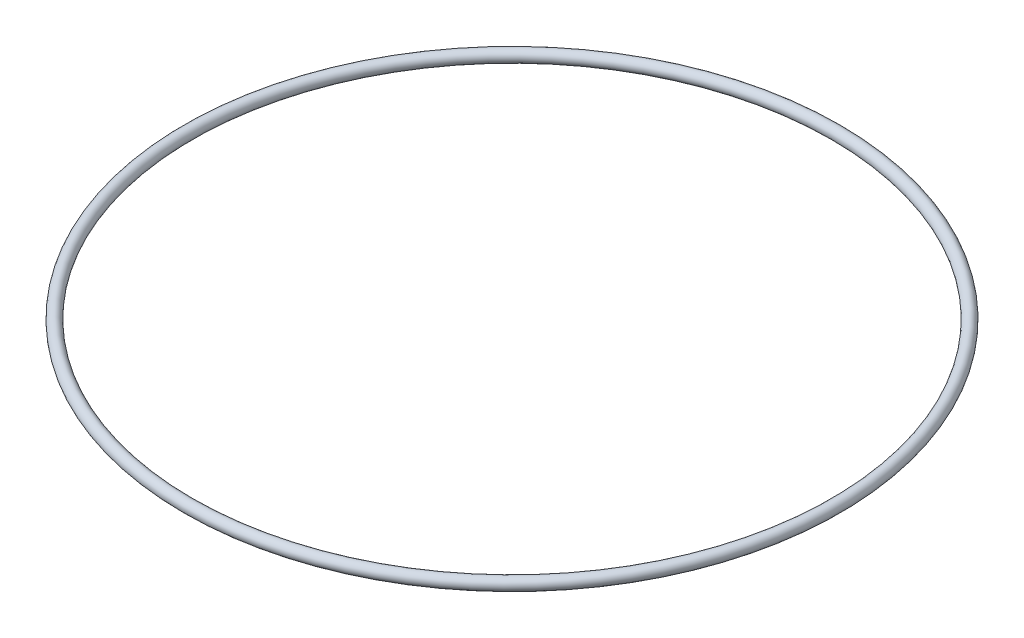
ISO-10303-21;
HEADER;
FILE_DESCRIPTION(('STEP AP214'),'2;1');
FILE_NAME('part.step','',(''),(''),'','','');
FILE_SCHEMA(('AUTOMOTIVE_DESIGN { 1 0 10303 214 1 1 1 1 }'));
ENDSEC;
DATA;
#1=APPLICATION_CONTEXT('core data for automotive mechanical design processes');
#2=APPLICATION_PROTOCOL_DEFINITION('international standard','automotive_design',2000,#1);
#3=PRODUCT_CONTEXT('',#1,'mechanical');
#4=PRODUCT('Part','Part','',(#3));
#5=PRODUCT_RELATED_PRODUCT_CATEGORY('part','',(#4));
#6=PRODUCT_DEFINITION_FORMATION('','',#4);
#7=PRODUCT_DEFINITION_CONTEXT('part definition',#1,'design');
#8=PRODUCT_DEFINITION('design','',#6,#7);
#9=PRODUCT_DEFINITION_SHAPE('','',#8);
#10=(LENGTH_UNIT() NAMED_UNIT(*) SI_UNIT(.MILLI.,.METRE.));
#11=(NAMED_UNIT(*) PLANE_ANGLE_UNIT() SI_UNIT($,.RADIAN.));
#12=(NAMED_UNIT(*) SI_UNIT($,.STERADIAN.) SOLID_ANGLE_UNIT());
#13=UNCERTAINTY_MEASURE_WITH_UNIT(LENGTH_MEASURE(1.E-05),#10,'distance_accuracy_value','');
#14=(GEOMETRIC_REPRESENTATION_CONTEXT(3) GLOBAL_UNCERTAINTY_ASSIGNED_CONTEXT((#13)) GLOBAL_UNIT_ASSIGNED_CONTEXT((#10,
#11,#12)) REPRESENTATION_CONTEXT('',''));
#15=CARTESIAN_POINT('',(0.,0.,0.));
#16=DIRECTION('',(0.,0.,1.));
#17=DIRECTION('',(1.,0.,0.));
#18=AXIS2_PLACEMENT_3D('',#15,#16,#17);
#19=CARTESIAN_POINT('',(0.,0.,0.));
#20=DIRECTION('',(0.,1.,0.));
#21=DIRECTION('',(0.,0.,1.));
#22=AXIS2_PLACEMENT_3D('',#19,#20,#21);
#23=TOROIDAL_SURFACE('',#22,81.5,1.5);
#24=CARTESIAN_POINT('',(0.,0.,83.));
#25=VERTEX_POINT('',#24);
#26=VERTEX_LOOP('',#25);
#27=FACE_BOUND('',#26,.T.);
#28=ADVANCED_FACE('F29',(#27),#23,.T.);
#29=CLOSED_SHELL('',(#28));
#30=MANIFOLD_SOLID_BREP('B2',#29);
#31=ADVANCED_BREP_SHAPE_REPRESENTATION('',(#18,#30),#14);
#32=SHAPE_DEFINITION_REPRESENTATION(#9,#31);
ENDSEC;
END-ISO-10303-21;
